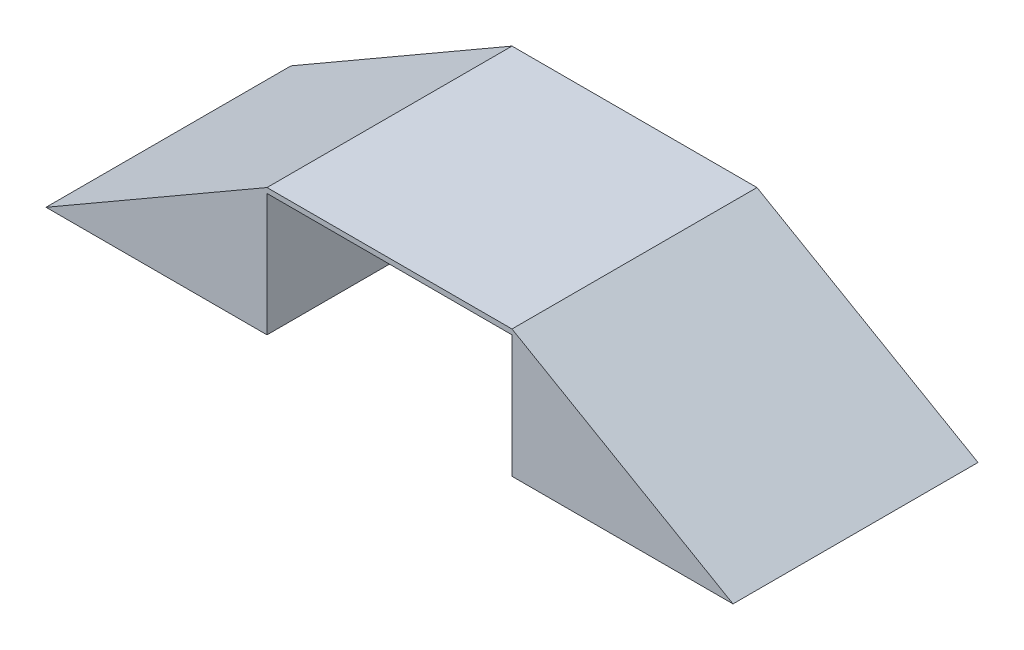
from build123d import *

# Parameters (mm, degrees)
BOSS_EXTRUDE1_DEPTH = 304.8
SKETCH5_W           = 609.6
SKETCH5_H           = 304.8
CUT_EXTRUDE1_DEPTH  = 609.6


with BuildPart() as part:
    # Sketch3 → Boss-Extrude1 (new, symmetric)
    with BuildSketch(Plane.XY):
        Polygon((-304.8, 317.5), (304.8, 317.5), (854.726131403, 0), (-854.726131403, 0), align=None)
    extrude(amount=BOSS_EXTRUDE1_DEPTH, both=True)

    # Sketch5 → Cut-Extrude1 (cut)
    with BuildSketch(Plane.XY.offset(304.8)):
        with Locations((0, 152.4)):
            Rectangle(SKETCH5_W, SKETCH5_H)
    extrude(amount=-CUT_EXTRUDE1_DEPTH, mode=Mode.SUBTRACT)


solid = part.part
